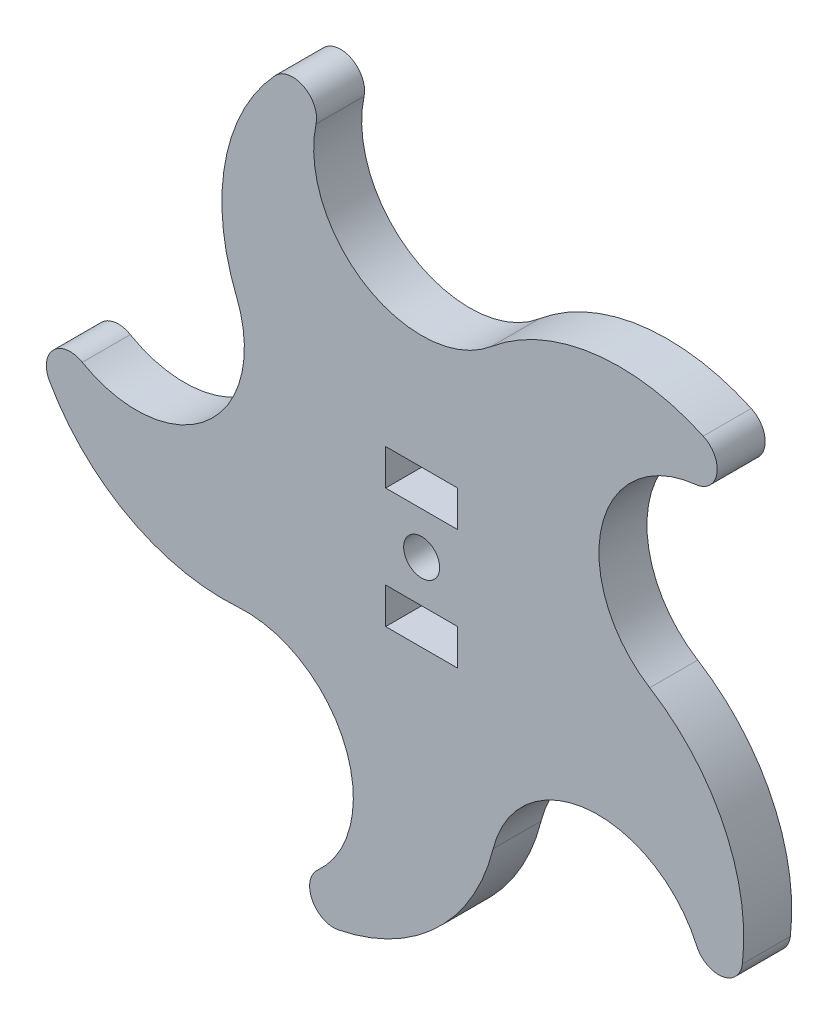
ISO-10303-21;
HEADER;
FILE_DESCRIPTION(('STEP AP214'),'2;1');
FILE_NAME('part.step','',(''),(''),'','','');
FILE_SCHEMA(('AUTOMOTIVE_DESIGN { 1 0 10303 214 1 1 1 1 }'));
ENDSEC;
DATA;
#1=APPLICATION_CONTEXT('core data for automotive mechanical design processes');
#2=APPLICATION_PROTOCOL_DEFINITION('international standard','automotive_design',2000,#1);
#3=PRODUCT_CONTEXT('',#1,'mechanical');
#4=PRODUCT('Part','Part','',(#3));
#5=PRODUCT_RELATED_PRODUCT_CATEGORY('part','',(#4));
#6=PRODUCT_DEFINITION_FORMATION('','',#4);
#7=PRODUCT_DEFINITION_CONTEXT('part definition',#1,'design');
#8=PRODUCT_DEFINITION('design','',#6,#7);
#9=PRODUCT_DEFINITION_SHAPE('','',#8);
#10=(LENGTH_UNIT() NAMED_UNIT(*) SI_UNIT(.MILLI.,.METRE.));
#11=(NAMED_UNIT(*) PLANE_ANGLE_UNIT() SI_UNIT($,.RADIAN.));
#12=(NAMED_UNIT(*) SI_UNIT($,.STERADIAN.) SOLID_ANGLE_UNIT());
#13=UNCERTAINTY_MEASURE_WITH_UNIT(LENGTH_MEASURE(1.E-05),#10,'distance_accuracy_value','');
#14=(GEOMETRIC_REPRESENTATION_CONTEXT(3) GLOBAL_UNCERTAINTY_ASSIGNED_CONTEXT((#13)) GLOBAL_UNIT_ASSIGNED_CONTEXT((#10,
#11,#12)) REPRESENTATION_CONTEXT('',''));
#15=CARTESIAN_POINT('',(0.,0.,0.));
#16=DIRECTION('',(0.,0.,1.));
#17=DIRECTION('',(1.,0.,0.));
#18=AXIS2_PLACEMENT_3D('',#15,#16,#17);
#19=CARTESIAN_POINT('',(-29.2829028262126,-1.79710467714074,4.));
#20=DIRECTION('',(0.,0.,-1.));
#21=DIRECTION('',(-1.,0.,0.));
#22=AXIS2_PLACEMENT_3D('',#19,#20,#21);
#23=CYLINDRICAL_SURFACE('',#22,2.);
#24=CARTESIAN_POINT('',(-29.2829028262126,-1.79710467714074,0.));
#25=DIRECTION('',(0.,0.,1.));
#26=DIRECTION('',(1.,0.,0.));
#27=AXIS2_PLACEMENT_3D('',#24,#25,#26);
#28=CIRCLE('',#27,2.);
#29=CARTESIAN_POINT('',(-28.28172284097,-0.0657356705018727,0.));
#30=VERTEX_POINT('',#29);
#31=CARTESIAN_POINT('',(-31.0278998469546,-2.77433822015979,0.));
#32=VERTEX_POINT('',#31);
#33=EDGE_CURVE('E275',#30,#32,#28,.T.);
#34=ORIENTED_EDGE('',*,*,#33,.T.);
#35=DIRECTION('',(0.,0.,-1.));
#36=VECTOR('',#35,1.);
#37=CARTESIAN_POINT('',(-31.0278998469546,-2.77433822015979,4.));
#38=LINE('',#37,#36);
#39=CARTESIAN_POINT('',(-31.0278998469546,-2.77433822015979,4.));
#40=VERTEX_POINT('',#39);
#41=EDGE_CURVE('E346',#40,#32,#38,.T.);
#42=ORIENTED_EDGE('',*,*,#41,.F.);
#43=CARTESIAN_POINT('',(-29.2829028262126,-1.79710467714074,4.));
#44=DIRECTION('',(0.,0.,1.));
#45=DIRECTION('',(1.,0.,0.));
#46=AXIS2_PLACEMENT_3D('',#43,#44,#45);
#47=CIRCLE('',#46,2.);
#48=CARTESIAN_POINT('',(-28.28172284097,-0.0657356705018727,4.));
#49=VERTEX_POINT('',#48);
#50=EDGE_CURVE('E242',#49,#40,#47,.T.);
#51=ORIENTED_EDGE('',*,*,#50,.F.);
#52=DIRECTION('',(0.,0.,-1.));
#53=VECTOR('',#52,1.);
#54=CARTESIAN_POINT('',(-28.28172284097,-0.0657356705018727,4.));
#55=LINE('',#54,#53);
#56=EDGE_CURVE('E274',#49,#30,#55,.T.);
#57=ORIENTED_EDGE('',*,*,#56,.T.);
#58=EDGE_LOOP('',(#34,#42,#51,#57));
#59=FACE_BOUND('',#58,.T.);
#60=ADVANCED_FACE('F33',(#59),#23,.T.);
#61=CARTESIAN_POINT('',(-16.5004563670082,5.36132327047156,4.));
#62=DIRECTION('',(0.,0.,-1.));
#63=DIRECTION('',(-1.,0.,0.));
#64=AXIS2_PLACEMENT_3D('',#61,#62,#63);
#65=CYLINDRICAL_SURFACE('',#64,16.6503934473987);
#66=CARTESIAN_POINT('',(-16.5004563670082,5.36132327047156,0.));
#67=DIRECTION('',(0.,0.,1.));
#68=DIRECTION('',(1.,0.,0.));
#69=AXIS2_PLACEMENT_3D('',#66,#67,#68);
#70=CIRCLE('',#69,16.6503934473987);
#71=CARTESIAN_POINT('',(-15.3282444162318,-11.2477562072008,0.));
#72=VERTEX_POINT('',#71);
#73=EDGE_CURVE('E278',#32,#72,#70,.T.);
#74=ORIENTED_EDGE('',*,*,#73,.T.);
#75=DIRECTION('',(0.,0.,-1.));
#76=VECTOR('',#75,1.);
#77=CARTESIAN_POINT('',(-15.3282444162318,-11.2477562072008,4.));
#78=LINE('',#77,#76);
#79=CARTESIAN_POINT('',(-15.3282444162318,-11.2477562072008,4.));
#80=VERTEX_POINT('',#79);
#81=EDGE_CURVE('E343',#80,#72,#78,.T.);
#82=ORIENTED_EDGE('',*,*,#81,.F.);
#83=CARTESIAN_POINT('',(-16.5004563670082,5.36132327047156,4.));
#84=DIRECTION('',(0.,0.,1.));
#85=DIRECTION('',(1.,0.,0.));
#86=AXIS2_PLACEMENT_3D('',#83,#84,#85);
#87=CIRCLE('',#86,16.6503934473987);
#88=EDGE_CURVE('E245',#40,#80,#87,.T.);
#89=ORIENTED_EDGE('',*,*,#88,.F.);
#90=ORIENTED_EDGE('',*,*,#41,.T.);
#91=EDGE_LOOP('',(#74,#82,#89,#90));
#92=FACE_BOUND('',#91,.T.);
#93=ADVANCED_FACE('F394',(#92),#65,.T.);
#94=CARTESIAN_POINT('',(-14.6946313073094,-20.2254248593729,4.));
#95=DIRECTION('',(0.,0.,-1.));
#96=DIRECTION('',(-1.,0.,0.));
#97=AXIS2_PLACEMENT_3D('',#94,#95,#96);
#98=CYLINDRICAL_SURFACE('',#97,8.99999999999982);
#99=CARTESIAN_POINT('',(-14.6946313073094,-20.2254248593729,0.));
#100=DIRECTION('',(0.,0.,-1.));
#101=DIRECTION('',(1.,0.,0.));
#102=AXIS2_PLACEMENT_3D('',#99,#100,#101);
#103=CIRCLE('',#102,8.99999999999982);
#104=CARTESIAN_POINT('',(-8.67701465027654,-26.9178302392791,0.));
#105=VERTEX_POINT('',#104);
#106=EDGE_CURVE('E280',#72,#105,#103,.T.);
#107=ORIENTED_EDGE('',*,*,#106,.T.);
#108=DIRECTION('',(0.,0.,-1.));
#109=VECTOR('',#108,1.);
#110=CARTESIAN_POINT('',(-8.67701465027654,-26.9178302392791,4.));
#111=LINE('',#110,#109);
#112=CARTESIAN_POINT('',(-8.67701465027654,-26.9178302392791,4.));
#113=VERTEX_POINT('',#112);
#114=EDGE_CURVE('E340',#113,#105,#111,.T.);
#115=ORIENTED_EDGE('',*,*,#114,.F.);
#116=CARTESIAN_POINT('',(-14.6946313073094,-20.2254248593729,4.));
#117=DIRECTION('',(0.,0.,-1.));
#118=DIRECTION('',(1.,0.,0.));
#119=AXIS2_PLACEMENT_3D('',#116,#117,#118);
#120=CIRCLE('',#119,8.99999999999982);
#121=EDGE_CURVE('E248',#80,#113,#120,.T.);
#122=ORIENTED_EDGE('',*,*,#121,.F.);
#123=ORIENTED_EDGE('',*,*,#81,.T.);
#124=EDGE_LOOP('',(#107,#115,#122,#123));
#125=FACE_BOUND('',#124,.T.);
#126=ADVANCED_FACE('F399',(#125),#98,.F.);
#127=CARTESIAN_POINT('',(-7.33976650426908,-28.405031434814,4.));
#128=DIRECTION('',(0.,0.,-1.));
#129=DIRECTION('',(-1.,0.,0.));
#130=AXIS2_PLACEMENT_3D('',#127,#128,#129);
#131=CYLINDRICAL_SURFACE('',#130,2.);
#132=CARTESIAN_POINT('',(-7.33976650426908,-28.405031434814,0.));
#133=DIRECTION('',(0.,0.,1.));
#134=DIRECTION('',(1.,0.,0.));
#135=AXIS2_PLACEMENT_3D('',#132,#133,#134);
#136=CIRCLE('',#135,2.);
#137=CARTESIAN_POINT('',(-6.94959590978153,-30.3666039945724,0.));
#138=VERTEX_POINT('',#137);
#139=EDGE_CURVE('E282',#105,#138,#136,.T.);
#140=ORIENTED_EDGE('',*,*,#139,.T.);
#141=DIRECTION('',(0.,0.,-1.));
#142=VECTOR('',#141,1.);
#143=CARTESIAN_POINT('',(-6.94959590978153,-30.3666039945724,4.));
#144=LINE('',#143,#142);
#145=CARTESIAN_POINT('',(-6.94959590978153,-30.3666039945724,4.));
#146=VERTEX_POINT('',#145);
#147=EDGE_CURVE('E337',#146,#138,#144,.T.);
#148=ORIENTED_EDGE('',*,*,#147,.F.);
#149=CARTESIAN_POINT('',(-7.33976650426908,-28.405031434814,4.));
#150=DIRECTION('',(0.,0.,1.));
#151=DIRECTION('',(1.,0.,0.));
#152=AXIS2_PLACEMENT_3D('',#149,#150,#151);
#153=CIRCLE('',#152,2.);
#154=EDGE_CURVE('E250',#113,#146,#153,.T.);
#155=ORIENTED_EDGE('',*,*,#154,.F.);
#156=ORIENTED_EDGE('',*,*,#114,.T.);
#157=EDGE_LOOP('',(#140,#148,#155,#156));
#158=FACE_BOUND('',#157,.T.);
#159=ADVANCED_FACE('F467',(#158),#131,.T.);
#160=CARTESIAN_POINT('',(-10.1978428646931,-14.0361265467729,4.));
#161=DIRECTION('',(0.,0.,-1.));
#162=DIRECTION('',(-1.,0.,0.));
#163=AXIS2_PLACEMENT_3D('',#160,#161,#162);
#164=CYLINDRICAL_SURFACE('',#163,16.6503934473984);
#165=CARTESIAN_POINT('',(-10.1978428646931,-14.0361265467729,0.));
#166=DIRECTION('',(0.,0.,1.));
#167=DIRECTION('',(1.,0.,0.));
#168=AXIS2_PLACEMENT_3D('',#165,#166,#167);
#169=CIRCLE('',#168,16.6503934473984);
#170=CARTESIAN_POINT('',(5.96056381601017,-18.0537745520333,0.));
#171=VERTEX_POINT('',#170);
#172=EDGE_CURVE('E284',#138,#171,#169,.T.);
#173=ORIENTED_EDGE('',*,*,#172,.T.);
#174=DIRECTION('',(0.,0.,-1.));
#175=VECTOR('',#174,1.);
#176=CARTESIAN_POINT('',(5.96056381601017,-18.0537745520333,4.));
#177=LINE('',#176,#175);
#178=CARTESIAN_POINT('',(5.96056381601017,-18.0537745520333,4.));
#179=VERTEX_POINT('',#178);
#180=EDGE_CURVE('E334',#179,#171,#177,.T.);
#181=ORIENTED_EDGE('',*,*,#180,.F.);
#182=CARTESIAN_POINT('',(-10.1978428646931,-14.0361265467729,4.));
#183=DIRECTION('',(0.,0.,1.));
#184=DIRECTION('',(1.,0.,0.));
#185=AXIS2_PLACEMENT_3D('',#182,#183,#184);
#186=CIRCLE('',#185,16.6503934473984);
#187=EDGE_CURVE('E252',#146,#179,#186,.T.);
#188=ORIENTED_EDGE('',*,*,#187,.F.);
#189=ORIENTED_EDGE('',*,*,#147,.T.);
#190=EDGE_LOOP('',(#173,#181,#188,#189));
#191=FACE_BOUND('',#190,.T.);
#192=ADVANCED_FACE('F464',(#191),#164,.T.);
#193=CARTESIAN_POINT('',(14.6946313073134,-20.2254248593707,4.));
#194=DIRECTION('',(0.,0.,-1.));
#195=DIRECTION('',(-1.,0.,0.));
#196=AXIS2_PLACEMENT_3D('',#193,#194,#195);
#197=CYLINDRICAL_SURFACE('',#196,9.00000000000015);
#198=CARTESIAN_POINT('',(14.6946313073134,-20.2254248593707,0.));
#199=DIRECTION('',(0.,0.,-1.));
#200=DIRECTION('',(1.,0.,0.));
#201=AXIS2_PLACEMENT_3D('',#198,#199,#200);
#202=CIRCLE('',#201,9.00000000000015);
#203=CARTESIAN_POINT('',(22.9190328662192,-16.5703983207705,0.));
#204=VERTEX_POINT('',#203);
#205=EDGE_CURVE('E286',#171,#204,#202,.T.);
#206=ORIENTED_EDGE('',*,*,#205,.T.);
#207=DIRECTION('',(0.,0.,-1.));
#208=VECTOR('',#207,1.);
#209=CARTESIAN_POINT('',(22.9190328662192,-16.5703983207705,4.));
#210=LINE('',#209,#208);
#211=CARTESIAN_POINT('',(22.9190328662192,-16.5703983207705,4.));
#212=VERTEX_POINT('',#211);
#213=EDGE_CURVE('E331',#212,#204,#210,.T.);
#214=ORIENTED_EDGE('',*,*,#213,.F.);
#215=CARTESIAN_POINT('',(14.6946313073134,-20.2254248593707,4.));
#216=DIRECTION('',(0.,0.,-1.));
#217=DIRECTION('',(1.,0.,0.));
#218=AXIS2_PLACEMENT_3D('',#215,#216,#217);
#219=CIRCLE('',#218,9.00000000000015);
#220=EDGE_CURVE('E254',#179,#212,#219,.T.);
#221=ORIENTED_EDGE('',*,*,#220,.F.);
#222=ORIENTED_EDGE('',*,*,#180,.T.);
#223=EDGE_LOOP('',(#206,#214,#221,#222));
#224=FACE_BOUND('',#223,.T.);
#225=ADVANCED_FACE('F460',(#224),#197,.F.);
#226=CARTESIAN_POINT('',(24.7466776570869,-15.7581702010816,4.));
#227=DIRECTION('',(0.,0.,-1.));
#228=DIRECTION('',(-1.,0.,0.));
#229=AXIS2_PLACEMENT_3D('',#226,#227,#228);
#230=CYLINDRICAL_SURFACE('',#229,2.);
#231=CARTESIAN_POINT('',(24.7466776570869,-15.7581702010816,0.));
#232=DIRECTION('',(0.,0.,1.));
#233=DIRECTION('',(1.,0.,0.));
#234=AXIS2_PLACEMENT_3D('',#231,#232,#233);
#235=CIRCLE('',#234,2.);
#236=CARTESIAN_POINT('',(26.732813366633,-15.9932551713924,0.));
#237=VERTEX_POINT('',#236);
#238=EDGE_CURVE('E288',#204,#237,#235,.T.);
#239=ORIENTED_EDGE('',*,*,#238,.T.);
#240=DIRECTION('',(0.,0.,-1.));
#241=VECTOR('',#240,1.);
#242=CARTESIAN_POINT('',(26.732813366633,-15.9932551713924,4.));
#243=LINE('',#242,#241);
#244=CARTESIAN_POINT('',(26.732813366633,-15.9932551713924,4.));
#245=VERTEX_POINT('',#244);
#246=EDGE_CURVE('E328',#245,#237,#243,.T.);
#247=ORIENTED_EDGE('',*,*,#246,.F.);
#248=CARTESIAN_POINT('',(24.7466776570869,-15.7581702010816,4.));
#249=DIRECTION('',(0.,0.,1.));
#250=DIRECTION('',(1.,0.,0.));
#251=AXIS2_PLACEMENT_3D('',#248,#249,#250);
#252=CIRCLE('',#251,2.);
#253=EDGE_CURVE('E256',#212,#245,#252,.T.);
#254=ORIENTED_EDGE('',*,*,#253,.F.);
#255=ORIENTED_EDGE('',*,*,#213,.T.);
#256=EDGE_LOOP('',(#239,#247,#254,#255));
#257=FACE_BOUND('',#256,.T.);
#258=ADVANCED_FACE('F455',(#257),#230,.T.);
#259=CARTESIAN_POINT('',(10.1978428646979,-14.0361265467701,4.));
#260=DIRECTION('',(0.,0.,-1.));
#261=DIRECTION('',(-1.,0.,0.));
#262=AXIS2_PLACEMENT_3D('',#259,#260,#261);
#263=CYLINDRICAL_SURFACE('',#262,16.6503934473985);
#264=CARTESIAN_POINT('',(10.1978428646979,-14.0361265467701,0.));
#265=DIRECTION('',(0.,0.,1.));
#266=DIRECTION('',(1.,0.,0.));
#267=AXIS2_PLACEMENT_3D('',#264,#265,#266);
#268=CIRCLE('',#267,16.6503934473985);
#269=CARTESIAN_POINT('',(19.0120754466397,0.0899099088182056,0.));
#270=VERTEX_POINT('',#269);
#271=EDGE_CURVE('E290',#237,#270,#268,.T.);
#272=ORIENTED_EDGE('',*,*,#271,.T.);
#273=DIRECTION('',(0.,0.,-1.));
#274=VECTOR('',#273,1.);
#275=CARTESIAN_POINT('',(19.0120754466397,0.0899099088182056,4.));
#276=LINE('',#275,#274);
#277=CARTESIAN_POINT('',(19.0120754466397,0.0899099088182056,4.));
#278=VERTEX_POINT('',#277);
#279=EDGE_CURVE('E325',#278,#270,#276,.T.);
#280=ORIENTED_EDGE('',*,*,#279,.F.);
#281=CARTESIAN_POINT('',(10.1978428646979,-14.0361265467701,4.));
#282=DIRECTION('',(0.,0.,1.));
#283=DIRECTION('',(1.,0.,0.));
#284=AXIS2_PLACEMENT_3D('',#281,#282,#283);
#285=CIRCLE('',#284,16.6503934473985);
#286=EDGE_CURVE('E258',#245,#278,#285,.T.);
#287=ORIENTED_EDGE('',*,*,#286,.F.);
#288=ORIENTED_EDGE('',*,*,#246,.T.);
#289=EDGE_LOOP('',(#272,#280,#287,#288));
#290=FACE_BOUND('',#289,.T.);
#291=ADVANCED_FACE('F449',(#290),#263,.T.);
#292=CARTESIAN_POINT('',(23.7764129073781,7.72542485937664,4.));
#293=DIRECTION('',(0.,0.,-1.));
#294=DIRECTION('',(-1.,0.,0.));
#295=AXIS2_PLACEMENT_3D('',#292,#293,#294);
#296=CYLINDRICAL_SURFACE('',#295,9.);
#297=CARTESIAN_POINT('',(23.7764129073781,7.72542485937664,0.));
#298=DIRECTION('',(0.,0.,-1.));
#299=DIRECTION('',(1.,0.,0.));
#300=AXIS2_PLACEMENT_3D('',#297,#298,#299);
#301=CIRCLE('',#300,9.);
#302=CARTESIAN_POINT('',(22.8417559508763,16.6767608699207,0.));
#303=VERTEX_POINT('',#302);
#304=EDGE_CURVE('E292',#270,#303,#301,.T.);
#305=ORIENTED_EDGE('',*,*,#304,.T.);
#306=DIRECTION('',(0.,0.,-1.));
#307=VECTOR('',#306,1.);
#308=CARTESIAN_POINT('',(22.8417559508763,16.6767608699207,4.));
#309=LINE('',#308,#307);
#310=CARTESIAN_POINT('',(22.8417559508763,16.6767608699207,4.));
#311=VERTEX_POINT('',#310);
#312=EDGE_CURVE('E322',#311,#303,#309,.T.);
#313=ORIENTED_EDGE('',*,*,#312,.F.);
#314=CARTESIAN_POINT('',(23.7764129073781,7.72542485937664,4.));
#315=DIRECTION('',(0.,0.,-1.));
#316=DIRECTION('',(1.,0.,0.));
#317=AXIS2_PLACEMENT_3D('',#314,#315,#316);
#318=CIRCLE('',#317,9.);
#319=EDGE_CURVE('E260',#278,#311,#318,.T.);
#320=ORIENTED_EDGE('',*,*,#319,.F.);
#321=ORIENTED_EDGE('',*,*,#279,.T.);
#322=EDGE_LOOP('',(#305,#313,#320,#321));
#323=FACE_BOUND('',#322,.T.);
#324=ADVANCED_FACE('F445',(#323),#296,.F.);
#325=CARTESIAN_POINT('',(22.634054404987,18.6659466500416,4.));
#326=DIRECTION('',(0.,0.,-1.));
#327=DIRECTION('',(-1.,0.,0.));
#328=AXIS2_PLACEMENT_3D('',#325,#326,#327);
#329=CYLINDRICAL_SURFACE('',#328,2.);
#330=CARTESIAN_POINT('',(22.634054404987,18.6659466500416,0.));
#331=DIRECTION('',(0.,0.,1.));
#332=DIRECTION('',(1.,0.,0.));
#333=AXIS2_PLACEMENT_3D('',#330,#331,#332);
#334=CIRCLE('',#333,2.);
#335=CARTESIAN_POINT('',(23.4713831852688,20.4822287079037,0.));
#336=VERTEX_POINT('',#335);
#337=EDGE_CURVE('E294',#303,#336,#334,.T.);
#338=ORIENTED_EDGE('',*,*,#337,.T.);
#339=DIRECTION('',(0.,0.,-1.));
#340=VECTOR('',#339,1.);
#341=CARTESIAN_POINT('',(23.4713831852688,20.4822287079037,4.));
#342=LINE('',#341,#340);
#343=CARTESIAN_POINT('',(23.4713831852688,20.4822287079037,4.));
#344=VERTEX_POINT('',#343);
#345=EDGE_CURVE('E319',#344,#336,#342,.T.);
#346=ORIENTED_EDGE('',*,*,#345,.F.);
#347=CARTESIAN_POINT('',(22.634054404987,18.6659466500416,4.));
#348=DIRECTION('',(0.,0.,1.));
#349=DIRECTION('',(1.,0.,0.));
#350=AXIS2_PLACEMENT_3D('',#347,#348,#349);
#351=CIRCLE('',#350,2.);
#352=EDGE_CURVE('E262',#311,#344,#351,.T.);
#353=ORIENTED_EDGE('',*,*,#352,.F.);
#354=ORIENTED_EDGE('',*,*,#312,.T.);
#355=EDGE_LOOP('',(#338,#346,#353,#354));
#356=FACE_BOUND('',#355,.T.);
#357=ADVANCED_FACE('F440',(#356),#329,.T.);
#358=CARTESIAN_POINT('',(16.5004563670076,5.3613232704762,4.));
#359=DIRECTION('',(0.,0.,-1.));
#360=DIRECTION('',(-1.,0.,0.));
#361=AXIS2_PLACEMENT_3D('',#358,#359,#360);
#362=CYLINDRICAL_SURFACE('',#361,16.6503934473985);
#363=CARTESIAN_POINT('',(16.5004563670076,5.3613232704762,0.));
#364=DIRECTION('',(0.,0.,1.));
#365=DIRECTION('',(1.,0.,0.));
#366=AXIS2_PLACEMENT_3D('',#363,#364,#365);
#367=CIRCLE('',#366,16.6503934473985);
#368=CARTESIAN_POINT('',(5.78954500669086,18.1093419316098,0.));
#369=VERTEX_POINT('',#368);
#370=EDGE_CURVE('E296',#336,#369,#367,.T.);
#371=ORIENTED_EDGE('',*,*,#370,.T.);
#372=DIRECTION('',(0.,0.,-1.));
#373=VECTOR('',#372,1.);
#374=CARTESIAN_POINT('',(5.78954500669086,18.1093419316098,4.));
#375=LINE('',#374,#373);
#376=CARTESIAN_POINT('',(5.78954500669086,18.1093419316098,4.));
#377=VERTEX_POINT('',#376);
#378=EDGE_CURVE('E316',#377,#369,#375,.T.);
#379=ORIENTED_EDGE('',*,*,#378,.F.);
#380=CARTESIAN_POINT('',(16.5004563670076,5.3613232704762,4.));
#381=DIRECTION('',(0.,0.,1.));
#382=DIRECTION('',(1.,0.,0.));
#383=AXIS2_PLACEMENT_3D('',#380,#381,#382);
#384=CIRCLE('',#383,16.6503934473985);
#385=EDGE_CURVE('E264',#344,#377,#384,.T.);
#386=ORIENTED_EDGE('',*,*,#385,.F.);
#387=ORIENTED_EDGE('',*,*,#345,.T.);
#388=EDGE_LOOP('',(#371,#379,#386,#387));
#389=FACE_BOUND('',#388,.T.);
#390=ADVANCED_FACE('F434',(#389),#362,.T.);
#391=CARTESIAN_POINT('',(-1.46100916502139E-12,25.0000000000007,4.));
#392=DIRECTION('',(0.,0.,-1.));
#393=DIRECTION('',(-1.,0.,0.));
#394=AXIS2_PLACEMENT_3D('',#391,#392,#393);
#395=CYLINDRICAL_SURFACE('',#394,8.99999999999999);
#396=CARTESIAN_POINT('',(-1.46100916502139E-12,25.0000000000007,0.));
#397=DIRECTION('',(0.,0.,-1.));
#398=DIRECTION('',(1.,0.,0.));
#399=AXIS2_PLACEMENT_3D('',#396,#397,#398);
#400=CIRCLE('',#399,8.99999999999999);
#401=CARTESIAN_POINT('',(-8.80205132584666,26.8772033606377,0.));
#402=VERTEX_POINT('',#401);
#403=EDGE_CURVE('E298',#369,#402,#400,.T.);
#404=ORIENTED_EDGE('',*,*,#403,.T.);
#405=DIRECTION('',(0.,0.,-1.));
#406=VECTOR('',#405,1.);
#407=CARTESIAN_POINT('',(-8.80205132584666,26.8772033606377,4.));
#408=LINE('',#407,#406);
#409=CARTESIAN_POINT('',(-8.80205132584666,26.8772033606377,4.));
#410=VERTEX_POINT('',#409);
#411=EDGE_CURVE('E313',#410,#402,#408,.T.);
#412=ORIENTED_EDGE('',*,*,#411,.F.);
#413=CARTESIAN_POINT('',(-1.46100916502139E-12,25.0000000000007,4.));
#414=DIRECTION('',(0.,0.,-1.));
#415=DIRECTION('',(1.,0.,0.));
#416=AXIS2_PLACEMENT_3D('',#413,#414,#415);
#417=CIRCLE('',#416,8.99999999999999);
#418=EDGE_CURVE('E266',#377,#410,#417,.T.);
#419=ORIENTED_EDGE('',*,*,#418,.F.);
#420=ORIENTED_EDGE('',*,*,#378,.T.);
#421=EDGE_LOOP('',(#404,#412,#419,#420));
#422=FACE_BOUND('',#421,.T.);
#423=ADVANCED_FACE('F430',(#422),#395,.F.);
#424=CARTESIAN_POINT('',(-10.75806273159,27.2943596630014,4.));
#425=DIRECTION('',(0.,0.,-1.));
#426=DIRECTION('',(-1.,0.,0.));
#427=AXIS2_PLACEMENT_3D('',#424,#425,#426);
#428=CYLINDRICAL_SURFACE('',#427,2.);
#429=CARTESIAN_POINT('',(-10.75806273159,27.2943596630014,0.));
#430=DIRECTION('',(0.,0.,1.));
#431=DIRECTION('',(1.,0.,0.));
#432=AXIS2_PLACEMENT_3D('',#429,#430,#431);
#433=CIRCLE('',#432,2.);
#434=CARTESIAN_POINT('',(-12.2267007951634,28.6519686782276,0.));
#435=VERTEX_POINT('',#434);
#436=EDGE_CURVE('E300',#402,#435,#433,.T.);
#437=ORIENTED_EDGE('',*,*,#436,.T.);
#438=DIRECTION('',(0.,0.,-1.));
#439=VECTOR('',#438,1.);
#440=CARTESIAN_POINT('',(-12.2267007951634,28.6519686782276,4.));
#441=LINE('',#440,#439);
#442=CARTESIAN_POINT('',(-12.2267007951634,28.6519686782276,4.));
#443=VERTEX_POINT('',#442);
#444=EDGE_CURVE('E310',#443,#435,#441,.T.);
#445=ORIENTED_EDGE('',*,*,#444,.F.);
#446=CARTESIAN_POINT('',(-10.75806273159,27.2943596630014,4.));
#447=DIRECTION('',(0.,0.,1.));
#448=DIRECTION('',(1.,0.,0.));
#449=AXIS2_PLACEMENT_3D('',#446,#447,#448);
#450=CIRCLE('',#449,2.);
#451=EDGE_CURVE('E268',#410,#443,#450,.T.);
#452=ORIENTED_EDGE('',*,*,#451,.F.);
#453=ORIENTED_EDGE('',*,*,#411,.T.);
#454=EDGE_LOOP('',(#437,#445,#452,#453));
#455=FACE_BOUND('',#454,.T.);
#456=ADVANCED_FACE('F425',(#455),#428,.T.);
#457=CARTESIAN_POINT('',(-1.99075572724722E-12,17.349606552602,4.));
#458=DIRECTION('',(0.,0.,-1.));
#459=DIRECTION('',(-1.,0.,0.));
#460=AXIS2_PLACEMENT_3D('',#457,#458,#459);
#461=CYLINDRICAL_SURFACE('',#460,16.6503934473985);
#462=CARTESIAN_POINT('',(-1.99075572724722E-12,17.349606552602,0.));
#463=DIRECTION('',(0.,0.,1.));
#464=DIRECTION('',(1.,0.,0.));
#465=AXIS2_PLACEMENT_3D('',#462,#463,#464);
#466=CIRCLE('',#465,16.6503934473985);
#467=CARTESIAN_POINT('',(-15.4339398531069,11.1022789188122,0.));
#468=VERTEX_POINT('',#467);
#469=EDGE_CURVE('E302',#435,#468,#466,.T.);
#470=ORIENTED_EDGE('',*,*,#469,.T.);
#471=DIRECTION('',(0.,0.,-1.));
#472=VECTOR('',#471,1.);
#473=CARTESIAN_POINT('',(-15.4339398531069,11.1022789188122,4.));
#474=LINE('',#473,#472);
#475=CARTESIAN_POINT('',(-15.4339398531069,11.1022789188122,4.));
#476=VERTEX_POINT('',#475);
#477=EDGE_CURVE('E307',#476,#468,#474,.T.);
#478=ORIENTED_EDGE('',*,*,#477,.F.);
#479=CARTESIAN_POINT('',(-1.99075572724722E-12,17.349606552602,4.));
#480=DIRECTION('',(0.,0.,1.));
#481=DIRECTION('',(1.,0.,0.));
#482=AXIS2_PLACEMENT_3D('',#479,#480,#481);
#483=CIRCLE('',#482,16.6503934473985);
#484=EDGE_CURVE('E270',#443,#476,#483,.T.);
#485=ORIENTED_EDGE('',*,*,#484,.F.);
#486=ORIENTED_EDGE('',*,*,#444,.T.);
#487=EDGE_LOOP('',(#470,#478,#485,#486));
#488=FACE_BOUND('',#487,.T.);
#489=ADVANCED_FACE('F419',(#488),#461,.T.);
#490=CARTESIAN_POINT('',(-23.7764129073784,7.72542485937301,4.));
#491=DIRECTION('',(0.,0.,-1.));
#492=DIRECTION('',(-1.,0.,0.));
#493=AXIS2_PLACEMENT_3D('',#490,#491,#492);
#494=CYLINDRICAL_SURFACE('',#493,9.);
#495=CARTESIAN_POINT('',(-23.7764129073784,7.72542485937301,0.));
#496=DIRECTION('',(0.,0.,-1.));
#497=DIRECTION('',(1.,0.,0.));
#498=AXIS2_PLACEMENT_3D('',#495,#496,#497);
#499=CIRCLE('',#498,9.);
#500=EDGE_CURVE('E246',#468,#30,#499,.T.);
#501=ORIENTED_EDGE('',*,*,#500,.T.);
#502=ORIENTED_EDGE('',*,*,#56,.F.);
#503=CARTESIAN_POINT('',(-23.7764129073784,7.72542485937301,4.));
#504=DIRECTION('',(0.,0.,-1.));
#505=DIRECTION('',(1.,0.,0.));
#506=AXIS2_PLACEMENT_3D('',#503,#504,#505);
#507=CIRCLE('',#506,9.);
#508=EDGE_CURVE('E272',#476,#49,#507,.T.);
#509=ORIENTED_EDGE('',*,*,#508,.F.);
#510=ORIENTED_EDGE('',*,*,#477,.T.);
#511=EDGE_LOOP('',(#501,#502,#509,#510));
#512=FACE_BOUND('',#511,.T.);
#513=ADVANCED_FACE('F417',(#512),#494,.F.);
#514=CARTESIAN_POINT('',(-22.8916795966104,1.78210929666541,4.));
#515=DIRECTION('',(0.,0.,1.));
#516=DIRECTION('',(1.,0.,0.));
#517=AXIS2_PLACEMENT_3D('',#514,#515,#516);
#518=PLANE('',#517);
#519=DIRECTION('',(0.,1.,0.));
#520=VECTOR('',#519,1.);
#521=CARTESIAN_POINT('',(3.,-6.5,4.));
#522=LINE('',#521,#520);
#523=CARTESIAN_POINT('',(3.,-6.5,4.));
#524=VERTEX_POINT('',#523);
#525=CARTESIAN_POINT('',(3.,-3.5,4.));
#526=VERTEX_POINT('',#525);
#527=EDGE_CURVE('E47',#524,#526,#522,.T.);
#528=ORIENTED_EDGE('',*,*,#527,.F.);
#529=DIRECTION('',(1.,0.,0.));
#530=VECTOR('',#529,1.);
#531=CARTESIAN_POINT('',(-3.,-6.5,4.));
#532=LINE('',#531,#530);
#533=CARTESIAN_POINT('',(-3.,-6.5,4.));
#534=VERTEX_POINT('',#533);
#535=EDGE_CURVE('E228',#534,#524,#532,.T.);
#536=ORIENTED_EDGE('',*,*,#535,.F.);
#537=DIRECTION('',(0.,-1.,0.));
#538=VECTOR('',#537,1.);
#539=CARTESIAN_POINT('',(-3.,-3.5,4.));
#540=LINE('',#539,#538);
#541=CARTESIAN_POINT('',(-3.,-3.5,4.));
#542=VERTEX_POINT('',#541);
#543=EDGE_CURVE('E225',#542,#534,#540,.T.);
#544=ORIENTED_EDGE('',*,*,#543,.F.);
#545=DIRECTION('',(-1.,0.,0.));
#546=VECTOR('',#545,1.);
#547=CARTESIAN_POINT('',(3.,-3.5,4.));
#548=LINE('',#547,#546);
#549=EDGE_CURVE('E222',#526,#542,#548,.T.);
#550=ORIENTED_EDGE('',*,*,#549,.F.);
#551=EDGE_LOOP('',(#528,#536,#544,#550));
#552=FACE_BOUND('',#551,.T.);
#553=DIRECTION('',(0.,1.,0.));
#554=VECTOR('',#553,1.);
#555=CARTESIAN_POINT('',(3.,6.5,4.));
#556=LINE('',#555,#554);
#557=CARTESIAN_POINT('',(3.,3.5,4.));
#558=VERTEX_POINT('',#557);
#559=CARTESIAN_POINT('',(3.,6.5,4.));
#560=VERTEX_POINT('',#559);
#561=EDGE_CURVE('E55',#558,#560,#556,.T.);
#562=ORIENTED_EDGE('',*,*,#561,.F.);
#563=DIRECTION('',(1.,0.,0.));
#564=VECTOR('',#563,1.);
#565=CARTESIAN_POINT('',(3.,3.5,4.));
#566=LINE('',#565,#564);
#567=CARTESIAN_POINT('',(-3.,3.5,4.));
#568=VERTEX_POINT('',#567);
#569=EDGE_CURVE('E211',#568,#558,#566,.T.);
#570=ORIENTED_EDGE('',*,*,#569,.F.);
#571=DIRECTION('',(0.,-1.,0.));
#572=VECTOR('',#571,1.);
#573=CARTESIAN_POINT('',(-3.,3.5,4.));
#574=LINE('',#573,#572);
#575=CARTESIAN_POINT('',(-3.,6.5,4.));
#576=VERTEX_POINT('',#575);
#577=EDGE_CURVE('E194',#576,#568,#574,.T.);
#578=ORIENTED_EDGE('',*,*,#577,.F.);
#579=DIRECTION('',(-1.,0.,0.));
#580=VECTOR('',#579,1.);
#581=CARTESIAN_POINT('',(-3.,6.5,4.));
#582=LINE('',#581,#580);
#583=EDGE_CURVE('E204',#560,#576,#582,.T.);
#584=ORIENTED_EDGE('',*,*,#583,.F.);
#585=EDGE_LOOP('',(#562,#570,#578,#584));
#586=FACE_BOUND('',#585,.T.);
#587=CARTESIAN_POINT('',(0.,0.,4.));
#588=DIRECTION('',(0.,0.,1.));
#589=DIRECTION('',(1.,0.,0.));
#590=AXIS2_PLACEMENT_3D('',#587,#588,#589);
#591=CIRCLE('',#590,1.5);
#592=CARTESIAN_POINT('',(1.5,0.,4.));
#593=VERTEX_POINT('',#592);
#594=EDGE_CURVE('E218',#593,#593,#591,.T.);
#595=ORIENTED_EDGE('',*,*,#594,.F.);
#596=EDGE_LOOP('',(#595));
#597=FACE_BOUND('',#596,.T.);
#598=ORIENTED_EDGE('',*,*,#50,.T.);
#599=ORIENTED_EDGE('',*,*,#88,.T.);
#600=ORIENTED_EDGE('',*,*,#121,.T.);
#601=ORIENTED_EDGE('',*,*,#154,.T.);
#602=ORIENTED_EDGE('',*,*,#187,.T.);
#603=ORIENTED_EDGE('',*,*,#220,.T.);
#604=ORIENTED_EDGE('',*,*,#253,.T.);
#605=ORIENTED_EDGE('',*,*,#286,.T.);
#606=ORIENTED_EDGE('',*,*,#319,.T.);
#607=ORIENTED_EDGE('',*,*,#352,.T.);
#608=ORIENTED_EDGE('',*,*,#385,.T.);
#609=ORIENTED_EDGE('',*,*,#418,.T.);
#610=ORIENTED_EDGE('',*,*,#451,.T.);
#611=ORIENTED_EDGE('',*,*,#484,.T.);
#612=ORIENTED_EDGE('',*,*,#508,.T.);
#613=EDGE_LOOP('',(#598,#599,#600,#601,#602,#603,#604,#605,#606,#607,#608,#609,#610,#611,#612));
#614=FACE_BOUND('',#613,.T.);
#615=ADVANCED_FACE('F208',(#552,#586,#597,#614),#518,.T.);
#616=CARTESIAN_POINT('',(-22.8916795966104,1.78210929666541,0.));
#617=DIRECTION('',(0.,0.,1.));
#618=DIRECTION('',(1.,0.,0.));
#619=AXIS2_PLACEMENT_3D('',#616,#617,#618);
#620=PLANE('',#619);
#621=DIRECTION('',(1.,0.,0.));
#622=VECTOR('',#621,1.);
#623=CARTESIAN_POINT('',(-22.8916795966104,-6.5,0.));
#624=LINE('',#623,#622);
#625=CARTESIAN_POINT('',(-3.,-6.5,0.));
#626=VERTEX_POINT('',#625);
#627=CARTESIAN_POINT('',(3.,-6.5,0.));
#628=VERTEX_POINT('',#627);
#629=EDGE_CURVE('E40',#626,#628,#624,.T.);
#630=ORIENTED_EDGE('',*,*,#629,.T.);
#631=DIRECTION('',(0.,1.,0.));
#632=VECTOR('',#631,1.);
#633=CARTESIAN_POINT('',(3.,1.78210929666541,0.));
#634=LINE('',#633,#632);
#635=CARTESIAN_POINT('',(3.,-3.5,0.));
#636=VERTEX_POINT('',#635);
#637=EDGE_CURVE('E11',#628,#636,#634,.T.);
#638=ORIENTED_EDGE('',*,*,#637,.T.);
#639=DIRECTION('',(-1.,0.,0.));
#640=VECTOR('',#639,1.);
#641=CARTESIAN_POINT('',(-22.8916795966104,-3.5,0.));
#642=LINE('',#641,#640);
#643=CARTESIAN_POINT('',(-3.,-3.5,0.));
#644=VERTEX_POINT('',#643);
#645=EDGE_CURVE('E360',#636,#644,#642,.T.);
#646=ORIENTED_EDGE('',*,*,#645,.T.);
#647=DIRECTION('',(0.,-1.,0.));
#648=VECTOR('',#647,1.);
#649=CARTESIAN_POINT('',(-3.,1.7821092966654,0.));
#650=LINE('',#649,#648);
#651=EDGE_CURVE('E363',#644,#626,#650,.T.);
#652=ORIENTED_EDGE('',*,*,#651,.T.);
#653=EDGE_LOOP('',(#630,#638,#646,#652));
#654=FACE_BOUND('',#653,.T.);
#655=DIRECTION('',(1.,0.,0.));
#656=VECTOR('',#655,1.);
#657=CARTESIAN_POINT('',(-22.8916795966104,3.5,0.));
#658=LINE('',#657,#656);
#659=CARTESIAN_POINT('',(-3.,3.5,0.));
#660=VERTEX_POINT('',#659);
#661=CARTESIAN_POINT('',(3.,3.5,0.));
#662=VERTEX_POINT('',#661);
#663=EDGE_CURVE('E354',#660,#662,#658,.T.);
#664=ORIENTED_EDGE('',*,*,#663,.T.);
#665=DIRECTION('',(0.,1.,0.));
#666=VECTOR('',#665,1.);
#667=CARTESIAN_POINT('',(3.,1.78210929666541,0.));
#668=LINE('',#667,#666);
#669=CARTESIAN_POINT('',(3.,6.5,0.));
#670=VERTEX_POINT('',#669);
#671=EDGE_CURVE('E357',#662,#670,#668,.T.);
#672=ORIENTED_EDGE('',*,*,#671,.T.);
#673=DIRECTION('',(-1.,0.,0.));
#674=VECTOR('',#673,1.);
#675=CARTESIAN_POINT('',(-22.8916795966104,6.5,0.));
#676=LINE('',#675,#674);
#677=CARTESIAN_POINT('',(-3.,6.5,0.));
#678=VERTEX_POINT('',#677);
#679=EDGE_CURVE('E349',#670,#678,#676,.T.);
#680=ORIENTED_EDGE('',*,*,#679,.T.);
#681=DIRECTION('',(0.,-1.,0.));
#682=VECTOR('',#681,1.);
#683=CARTESIAN_POINT('',(-3.,1.78210929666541,0.));
#684=LINE('',#683,#682);
#685=EDGE_CURVE('E197',#678,#660,#684,.T.);
#686=ORIENTED_EDGE('',*,*,#685,.T.);
#687=EDGE_LOOP('',(#664,#672,#680,#686));
#688=FACE_BOUND('',#687,.T.);
#689=CARTESIAN_POINT('',(0.,0.,0.));
#690=DIRECTION('',(0.,0.,1.));
#691=DIRECTION('',(1.,0.,0.));
#692=AXIS2_PLACEMENT_3D('',#689,#690,#691);
#693=CIRCLE('',#692,1.5);
#694=CARTESIAN_POINT('',(1.5,0.,0.));
#695=VERTEX_POINT('',#694);
#696=EDGE_CURVE('E241',#695,#695,#693,.T.);
#697=ORIENTED_EDGE('',*,*,#696,.T.);
#698=EDGE_LOOP('',(#697));
#699=FACE_BOUND('',#698,.T.);
#700=ORIENTED_EDGE('',*,*,#33,.F.);
#701=ORIENTED_EDGE('',*,*,#500,.F.);
#702=ORIENTED_EDGE('',*,*,#469,.F.);
#703=ORIENTED_EDGE('',*,*,#436,.F.);
#704=ORIENTED_EDGE('',*,*,#403,.F.);
#705=ORIENTED_EDGE('',*,*,#370,.F.);
#706=ORIENTED_EDGE('',*,*,#337,.F.);
#707=ORIENTED_EDGE('',*,*,#304,.F.);
#708=ORIENTED_EDGE('',*,*,#271,.F.);
#709=ORIENTED_EDGE('',*,*,#238,.F.);
#710=ORIENTED_EDGE('',*,*,#205,.F.);
#711=ORIENTED_EDGE('',*,*,#172,.F.);
#712=ORIENTED_EDGE('',*,*,#139,.F.);
#713=ORIENTED_EDGE('',*,*,#106,.F.);
#714=ORIENTED_EDGE('',*,*,#73,.F.);
#715=EDGE_LOOP('',(#700,#701,#702,#703,#704,#705,#706,#707,#708,#709,#710,#711,#712,#713,#714));
#716=FACE_BOUND('',#715,.T.);
#717=ADVANCED_FACE('F367',(#654,#688,#699,#716),#620,.F.);
#718=CARTESIAN_POINT('',(0.,0.,-6.));
#719=DIRECTION('',(0.,0.,1.));
#720=DIRECTION('',(1.,0.,0.));
#721=AXIS2_PLACEMENT_3D('',#718,#719,#720);
#722=CYLINDRICAL_SURFACE('',#721,1.5);
#723=ORIENTED_EDGE('',*,*,#594,.T.);
#724=EDGE_LOOP('',(#723));
#725=FACE_BOUND('',#724,.T.);
#726=ORIENTED_EDGE('',*,*,#696,.F.);
#727=EDGE_LOOP('',(#726));
#728=FACE_BOUND('',#727,.T.);
#729=ADVANCED_FACE('F502',(#725,#728),#722,.F.);
#730=CARTESIAN_POINT('',(3.,6.5,-6.));
#731=DIRECTION('',(1.,0.,0.));
#732=DIRECTION('',(0.,0.,-1.));
#733=AXIS2_PLACEMENT_3D('',#730,#731,#732);
#734=PLANE('',#733);
#735=DIRECTION('',(0.,0.,1.));
#736=VECTOR('',#735,1.);
#737=CARTESIAN_POINT('',(3.,3.5,-6.));
#738=LINE('',#737,#736);
#739=EDGE_CURVE('E216',#662,#558,#738,.T.);
#740=ORIENTED_EDGE('',*,*,#739,.T.);
#741=ORIENTED_EDGE('',*,*,#561,.T.);
#742=DIRECTION('',(0.,0.,1.));
#743=VECTOR('',#742,1.);
#744=CARTESIAN_POINT('',(3.,6.5,-6.));
#745=LINE('',#744,#743);
#746=EDGE_CURVE('E201',#670,#560,#745,.T.);
#747=ORIENTED_EDGE('',*,*,#746,.F.);
#748=ORIENTED_EDGE('',*,*,#671,.F.);
#749=EDGE_LOOP('',(#740,#741,#747,#748));
#750=FACE_BOUND('',#749,.T.);
#751=ADVANCED_FACE('F505',(#750),#734,.F.);
#752=CARTESIAN_POINT('',(3.,3.5,-6.));
#753=DIRECTION('',(0.,-1.,0.));
#754=DIRECTION('',(0.,0.,-1.));
#755=AXIS2_PLACEMENT_3D('',#752,#753,#754);
#756=PLANE('',#755);
#757=DIRECTION('',(0.,0.,1.));
#758=VECTOR('',#757,1.);
#759=CARTESIAN_POINT('',(-3.,3.5,-6.));
#760=LINE('',#759,#758);
#761=EDGE_CURVE('E200',#660,#568,#760,.T.);
#762=ORIENTED_EDGE('',*,*,#761,.T.);
#763=ORIENTED_EDGE('',*,*,#569,.T.);
#764=ORIENTED_EDGE('',*,*,#739,.F.);
#765=ORIENTED_EDGE('',*,*,#663,.F.);
#766=EDGE_LOOP('',(#762,#763,#764,#765));
#767=FACE_BOUND('',#766,.T.);
#768=ADVANCED_FACE('F510',(#767),#756,.F.);
#769=CARTESIAN_POINT('',(-3.,3.5,-6.));
#770=DIRECTION('',(-1.,0.,0.));
#771=DIRECTION('',(0.,0.,1.));
#772=AXIS2_PLACEMENT_3D('',#769,#770,#771);
#773=PLANE('',#772);
#774=DIRECTION('',(0.,0.,1.));
#775=VECTOR('',#774,1.);
#776=CARTESIAN_POINT('',(-3.,6.5,-6.));
#777=LINE('',#776,#775);
#778=EDGE_CURVE('E189',#678,#576,#777,.T.);
#779=ORIENTED_EDGE('',*,*,#778,.T.);
#780=ORIENTED_EDGE('',*,*,#577,.T.);
#781=ORIENTED_EDGE('',*,*,#761,.F.);
#782=ORIENTED_EDGE('',*,*,#685,.F.);
#783=EDGE_LOOP('',(#779,#780,#781,#782));
#784=FACE_BOUND('',#783,.T.);
#785=ADVANCED_FACE('F191',(#784),#773,.F.);
#786=CARTESIAN_POINT('',(-3.,6.5,-6.));
#787=DIRECTION('',(0.,1.,0.));
#788=DIRECTION('',(0.,0.,1.));
#789=AXIS2_PLACEMENT_3D('',#786,#787,#788);
#790=PLANE('',#789);
#791=ORIENTED_EDGE('',*,*,#746,.T.);
#792=ORIENTED_EDGE('',*,*,#583,.T.);
#793=ORIENTED_EDGE('',*,*,#778,.F.);
#794=ORIENTED_EDGE('',*,*,#679,.F.);
#795=EDGE_LOOP('',(#791,#792,#793,#794));
#796=FACE_BOUND('',#795,.T.);
#797=ADVANCED_FACE('F205',(#796),#790,.F.);
#798=CARTESIAN_POINT('',(3.,-6.5,-6.));
#799=DIRECTION('',(1.,0.,0.));
#800=DIRECTION('',(0.,0.,-1.));
#801=AXIS2_PLACEMENT_3D('',#798,#799,#800);
#802=PLANE('',#801);
#803=DIRECTION('',(0.,0.,1.));
#804=VECTOR('',#803,1.);
#805=CARTESIAN_POINT('',(3.,-6.5,-6.));
#806=LINE('',#805,#804);
#807=EDGE_CURVE('E232',#628,#524,#806,.T.);
#808=ORIENTED_EDGE('',*,*,#807,.T.);
#809=ORIENTED_EDGE('',*,*,#527,.T.);
#810=DIRECTION('',(0.,0.,1.));
#811=VECTOR('',#810,1.);
#812=CARTESIAN_POINT('',(3.,-3.5,-6.));
#813=LINE('',#812,#811);
#814=EDGE_CURVE('E231',#636,#526,#813,.T.);
#815=ORIENTED_EDGE('',*,*,#814,.F.);
#816=ORIENTED_EDGE('',*,*,#637,.F.);
#817=EDGE_LOOP('',(#808,#809,#815,#816));
#818=FACE_BOUND('',#817,.T.);
#819=ADVANCED_FACE('F382',(#818),#802,.F.);
#820=CARTESIAN_POINT('',(-3.,-6.5,-6.));
#821=DIRECTION('',(0.,-1.,0.));
#822=DIRECTION('',(1.,0.,0.));
#823=AXIS2_PLACEMENT_3D('',#820,#821,#822);
#824=PLANE('',#823);
#825=DIRECTION('',(0.,0.,1.));
#826=VECTOR('',#825,1.);
#827=CARTESIAN_POINT('',(-3.,-6.5,-6.));
#828=LINE('',#827,#826);
#829=EDGE_CURVE('E234',#626,#534,#828,.T.);
#830=ORIENTED_EDGE('',*,*,#829,.T.);
#831=ORIENTED_EDGE('',*,*,#535,.T.);
#832=ORIENTED_EDGE('',*,*,#807,.F.);
#833=ORIENTED_EDGE('',*,*,#629,.F.);
#834=EDGE_LOOP('',(#830,#831,#832,#833));
#835=FACE_BOUND('',#834,.T.);
#836=ADVANCED_FACE('F373',(#835),#824,.F.);
#837=CARTESIAN_POINT('',(-3.,-3.5,-6.));
#838=DIRECTION('',(-1.,0.,0.));
#839=DIRECTION('',(0.,-1.,0.));
#840=AXIS2_PLACEMENT_3D('',#837,#838,#839);
#841=PLANE('',#840);
#842=DIRECTION('',(0.,0.,1.));
#843=VECTOR('',#842,1.);
#844=CARTESIAN_POINT('',(-3.,-3.5,-6.));
#845=LINE('',#844,#843);
#846=EDGE_CURVE('E236',#644,#542,#845,.T.);
#847=ORIENTED_EDGE('',*,*,#846,.T.);
#848=ORIENTED_EDGE('',*,*,#543,.T.);
#849=ORIENTED_EDGE('',*,*,#829,.F.);
#850=ORIENTED_EDGE('',*,*,#651,.F.);
#851=EDGE_LOOP('',(#847,#848,#849,#850));
#852=FACE_BOUND('',#851,.T.);
#853=ADVANCED_FACE('F375',(#852),#841,.F.);
#854=CARTESIAN_POINT('',(3.,-3.5,-6.));
#855=DIRECTION('',(0.,1.,0.));
#856=DIRECTION('',(0.,0.,1.));
#857=AXIS2_PLACEMENT_3D('',#854,#855,#856);
#858=PLANE('',#857);
#859=ORIENTED_EDGE('',*,*,#814,.T.);
#860=ORIENTED_EDGE('',*,*,#549,.T.);
#861=ORIENTED_EDGE('',*,*,#846,.F.);
#862=ORIENTED_EDGE('',*,*,#645,.F.);
#863=EDGE_LOOP('',(#859,#860,#861,#862));
#864=FACE_BOUND('',#863,.T.);
#865=ADVANCED_FACE('F381',(#864),#858,.F.);
#866=CLOSED_SHELL('',(#60,#93,#126,#159,#192,#225,#258,#291,#324,#357,#390,#423,#456,#489,#513,
#615,#717,#729,#751,#768,#785,#797,#819,#836,#853,#865));
#867=MANIFOLD_SOLID_BREP('B2',#866);
#868=ADVANCED_BREP_SHAPE_REPRESENTATION('',(#18,#867),#14);
#869=SHAPE_DEFINITION_REPRESENTATION(#9,#868);
ENDSEC;
END-ISO-10303-21;
